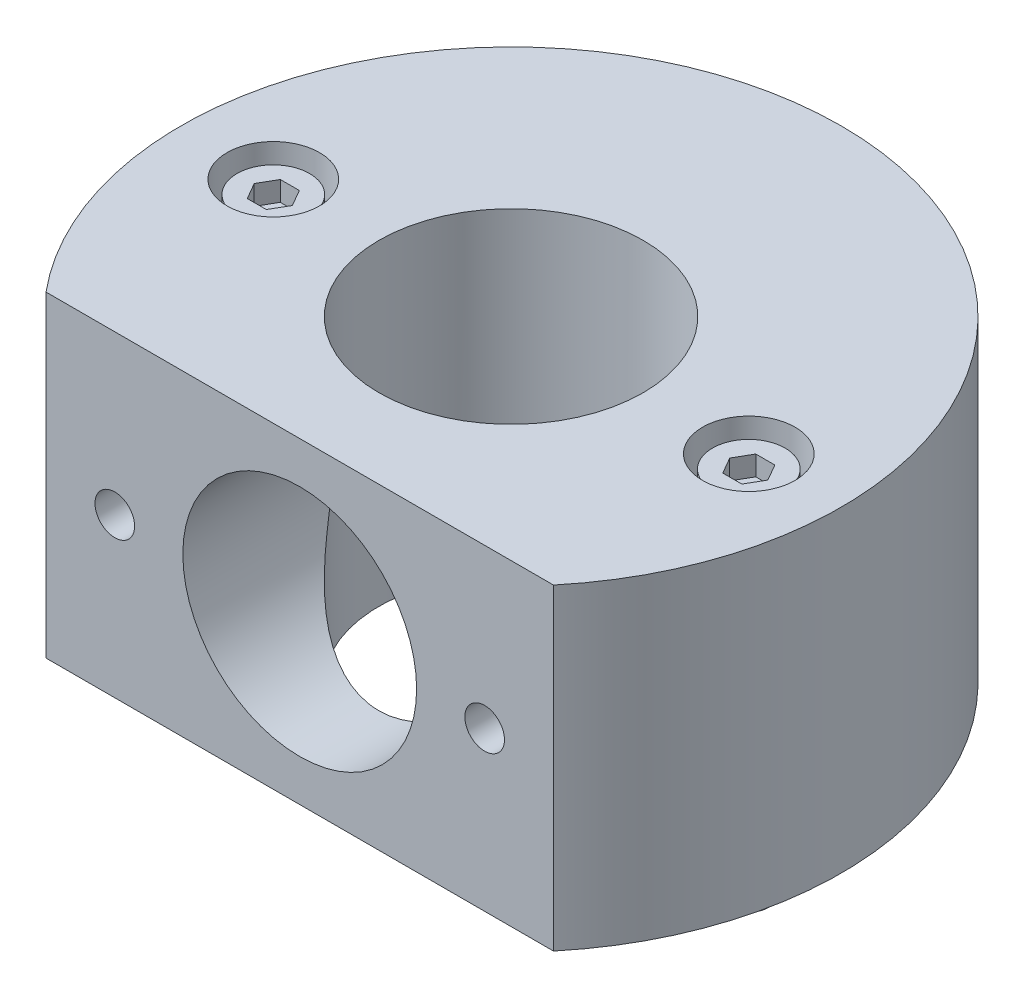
ISO-10303-21;
HEADER;
FILE_DESCRIPTION(('STEP AP214'),'2;1');
FILE_NAME('part.step','',(''),(''),'','','');
FILE_SCHEMA(('AUTOMOTIVE_DESIGN { 1 0 10303 214 1 1 1 1 }'));
ENDSEC;
DATA;
#1=APPLICATION_CONTEXT('core data for automotive mechanical design processes');
#2=APPLICATION_PROTOCOL_DEFINITION('international standard','automotive_design',2000,#1);
#3=PRODUCT_CONTEXT('',#1,'mechanical');
#4=PRODUCT('Part','Part','',(#3));
#5=PRODUCT_RELATED_PRODUCT_CATEGORY('part','',(#4));
#6=PRODUCT_DEFINITION_FORMATION('','',#4);
#7=PRODUCT_DEFINITION_CONTEXT('part definition',#1,'design');
#8=PRODUCT_DEFINITION('design','',#6,#7);
#9=PRODUCT_DEFINITION_SHAPE('','',#8);
#10=(LENGTH_UNIT() NAMED_UNIT(*) SI_UNIT(.MILLI.,.METRE.));
#11=(NAMED_UNIT(*) PLANE_ANGLE_UNIT() SI_UNIT($,.RADIAN.));
#12=(NAMED_UNIT(*) SI_UNIT($,.STERADIAN.) SOLID_ANGLE_UNIT());
#13=UNCERTAINTY_MEASURE_WITH_UNIT(LENGTH_MEASURE(1.E-05),#10,'distance_accuracy_value','');
#14=(GEOMETRIC_REPRESENTATION_CONTEXT(3) GLOBAL_UNCERTAINTY_ASSIGNED_CONTEXT((#13)) GLOBAL_UNIT_ASSIGNED_CONTEXT((#10,
#11,#12)) REPRESENTATION_CONTEXT('',''));
#15=CARTESIAN_POINT('',(0.,0.,0.));
#16=DIRECTION('',(0.,0.,1.));
#17=DIRECTION('',(1.,0.,0.));
#18=AXIS2_PLACEMENT_3D('',#15,#16,#17);
#19=CARTESIAN_POINT('',(-1.6759110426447E-13,24.,0.));
#20=DIRECTION('',(0.,-1.,0.));
#21=DIRECTION('',(1.,0.,0.));
#22=AXIS2_PLACEMENT_3D('',#19,#20,#21);
#23=CYLINDRICAL_SURFACE('',#22,10.);
#24=CARTESIAN_POINT('',(0.,0.,0.));
#25=DIRECTION('',(0.,-1.,0.));
#26=DIRECTION('',(1.,0.,0.));
#27=AXIS2_PLACEMENT_3D('',#24,#25,#26);
#28=CIRCLE('',#27,10.);
#29=CARTESIAN_POINT('',(10.,0.,0.));
#30=VERTEX_POINT('',#29);
#31=EDGE_CURVE('E272',#30,#30,#28,.T.);
#32=ORIENTED_EDGE('',*,*,#31,.T.);
#33=EDGE_LOOP('',(#32));
#34=FACE_BOUND('',#33,.T.);
#35=CARTESIAN_POINT('',(0.,3.15000000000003,10.));
#36=CARTESIAN_POINT('',(0.206380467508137,3.14999912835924,10.0000008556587));
#37=CARTESIAN_POINT('',(0.412750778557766,3.15723077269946,9.99359909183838));
#38=CARTESIAN_POINT('',(0.823691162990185,3.18600816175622,9.9681446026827));
#39=CARTESIAN_POINT('',(1.02826133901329,3.20755308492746,9.94909260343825));
#40=CARTESIAN_POINT('',(1.43396856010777,3.26454276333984,9.89876430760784));
#41=CARTESIAN_POINT('',(1.63510474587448,3.29999094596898,9.86748499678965));
#42=CARTESIAN_POINT('',(2.0324039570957,3.38413830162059,9.79337408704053));
#43=CARTESIAN_POINT('',(2.22856680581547,3.43283794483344,9.75054207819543));
#44=CARTESIAN_POINT('',(2.61342425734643,3.54232360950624,9.65448624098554));
#45=CARTESIAN_POINT('',(2.80215859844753,3.60303034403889,9.60133062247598));
#46=CARTESIAN_POINT('',(3.17258799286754,3.73586515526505,9.48537687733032));
#47=CARTESIAN_POINT('',(3.35427991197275,3.80799824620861,9.42257451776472));
#48=CARTESIAN_POINT('',(3.70980998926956,3.96274934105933,9.28834833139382));
#49=CARTESIAN_POINT('',(3.88364858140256,4.04536676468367,9.21692498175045));
#50=CARTESIAN_POINT('',(4.22301208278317,4.22021068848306,9.06645689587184));
#51=CARTESIAN_POINT('',(4.38853513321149,4.31243932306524,8.98741046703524));
#52=CARTESIAN_POINT('',(4.77399760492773,4.54347298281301,8.79046888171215));
#53=CARTESIAN_POINT('',(4.98990343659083,4.68638764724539,8.66947011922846));
#54=CARTESIAN_POINT('',(5.40458421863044,4.98725111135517,8.41720967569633));
#55=CARTESIAN_POINT('',(5.6033529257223,5.14520534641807,8.28594428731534));
#56=CARTESIAN_POINT('',(5.98409067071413,5.47491605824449,8.0153179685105));
#57=CARTESIAN_POINT('',(6.16602108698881,5.64670265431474,7.87593956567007));
#58=CARTESIAN_POINT('',(6.51269405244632,6.00258147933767,7.59177462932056));
#59=CARTESIAN_POINT('',(6.67743888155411,6.18667207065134,7.44698881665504));
#60=CARTESIAN_POINT('',(6.99346845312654,6.57071598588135,7.15117253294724));
#61=CARTESIAN_POINT('',(7.14437099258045,6.77093154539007,7.00007480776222));
#62=CARTESIAN_POINT('',(7.42867018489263,7.18334942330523,6.69760641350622));
#63=CARTESIAN_POINT('',(7.56206158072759,7.39555531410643,6.54623567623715));
#64=CARTESIAN_POINT('',(7.81102911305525,7.83186908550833,6.24704704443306));
#65=CARTESIAN_POINT('',(7.9266382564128,8.05595385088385,6.09922300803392));
#66=CARTESIAN_POINT('',(8.1398755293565,8.51726119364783,5.8115760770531));
#67=CARTESIAN_POINT('',(8.23751656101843,8.7544741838,5.67174749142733));
#68=CARTESIAN_POINT('',(8.41528968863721,9.24768772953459,5.40453567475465));
#69=CARTESIAN_POINT('',(8.49512079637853,9.50392589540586,5.27738396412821));
#70=CARTESIAN_POINT('',(8.63299449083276,10.0331527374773,5.04868337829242));
#71=CARTESIAN_POINT('',(8.69107208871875,10.3061136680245,4.94709344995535));
#72=CARTESIAN_POINT('',(8.77458847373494,10.8228317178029,4.79717917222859));
#73=CARTESIAN_POINT('',(8.80379230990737,11.0641487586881,4.74288934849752));
#74=CARTESIAN_POINT('',(8.83254889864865,11.4310606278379,4.68897062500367));
#75=CARTESIAN_POINT('',(8.83962645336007,11.5541235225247,4.67558354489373));
#76=CARTESIAN_POINT('',(8.84862687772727,11.8011330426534,4.65853098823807));
#77=CARTESIAN_POINT('',(8.85054987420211,11.925079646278,4.65486527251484));
#78=CARTESIAN_POINT('',(8.84917800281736,12.1730688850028,4.65747240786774));
#79=CARTESIAN_POINT('',(8.8458734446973,12.2971112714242,4.66376371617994));
#80=CARTESIAN_POINT('',(8.83412766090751,12.5440551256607,4.68597215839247));
#81=CARTESIAN_POINT('',(8.82568628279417,12.6669565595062,4.70188957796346));
#82=CARTESIAN_POINT('',(8.79290164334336,13.033123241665,4.76309635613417));
#83=CARTESIAN_POINT('',(8.76110012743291,13.2735679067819,4.82183460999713));
#84=CARTESIAN_POINT('',(8.68932062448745,13.6888066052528,4.94971718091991));
#85=CARTESIAN_POINT('',(8.6528806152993,13.8660296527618,5.01340172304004));
#86=CARTESIAN_POINT('',(8.57057502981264,14.2135016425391,5.15284515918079));
#87=CARTESIAN_POINT('',(8.5247034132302,14.3837460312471,5.22861178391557));
#88=CARTESIAN_POINT('',(8.42412730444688,14.7179338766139,5.38916281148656));
#89=CARTESIAN_POINT('',(8.36939242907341,14.8818531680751,5.47397787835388));
#90=CARTESIAN_POINT('',(8.25173000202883,15.2032342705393,5.64979347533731));
#91=CARTESIAN_POINT('',(8.18880323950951,15.3606967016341,5.74079340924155));
#92=CARTESIAN_POINT('',(8.00787687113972,15.7787542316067,5.99266286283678));
#93=CARTESIAN_POINT('',(7.88235011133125,16.0337137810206,6.157521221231));
#94=CARTESIAN_POINT('',(7.60909131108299,16.5281343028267,6.49219193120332));
#95=CARTESIAN_POINT('',(7.46134510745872,16.7675852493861,6.66200738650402));
#96=CARTESIAN_POINT('',(7.1438507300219,17.2313274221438,7.00138364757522));
#97=CARTESIAN_POINT('',(6.97411685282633,17.4556283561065,7.1709445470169));
#98=CARTESIAN_POINT('',(6.61240140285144,17.8888205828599,7.50578947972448));
#99=CARTESIAN_POINT('',(6.42042973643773,18.0977186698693,7.67107537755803));
#100=CARTESIAN_POINT('',(6.05516055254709,18.4582765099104,7.96102007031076));
#101=CARTESIAN_POINT('',(5.88597462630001,18.6129511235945,8.08711870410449));
#102=CARTESIAN_POINT('',(5.53314197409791,18.9108714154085,8.33249688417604));
#103=CARTESIAN_POINT('',(5.34949518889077,19.0541170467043,8.45177640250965));
#104=CARTESIAN_POINT('',(4.96810411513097,19.3277167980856,8.68144117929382));
#105=CARTESIAN_POINT('',(4.77038192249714,19.4580903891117,8.79183982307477));
#106=CARTESIAN_POINT('',(4.3609178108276,19.7046720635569,9.00196149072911));
#107=CARTESIAN_POINT('',(4.14917916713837,19.8208834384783,9.10168699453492));
#108=CARTESIAN_POINT('',(3.75685635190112,20.015374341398,9.26940261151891));
#109=CARTESIAN_POINT('',(3.57870341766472,20.0965599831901,9.3397206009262));
#110=CARTESIAN_POINT('',(3.21453755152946,20.2479154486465,9.47123038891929));
#111=CARTESIAN_POINT('',(3.02852633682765,20.3180876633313,9.53242416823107));
#112=CARTESIAN_POINT('',(2.64949037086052,20.4464620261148,9.6446487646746));
#113=CARTESIAN_POINT('',(2.45646787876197,20.5046679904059,9.6956828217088));
#114=CARTESIAN_POINT('',(2.06442887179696,20.6082362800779,9.78665514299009));
#115=CARTESIAN_POINT('',(1.86541228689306,20.6535984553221,9.82659327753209));
#116=CARTESIAN_POINT('',(1.46147735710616,20.730929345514,9.89476080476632));
#117=CARTESIAN_POINT('',(1.25652988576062,20.7628125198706,9.92291540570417));
#118=CARTESIAN_POINT('',(0.84355653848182,20.8121593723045,9.96651990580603));
#119=CARTESIAN_POINT('',(0.635530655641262,20.8296230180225,9.98196977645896));
#120=CARTESIAN_POINT('',(0.218262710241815,20.8497728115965,9.99979783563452));
#121=CARTESIAN_POINT('',(0.00902101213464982,20.8524631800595,10.0021797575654));
#122=CARTESIAN_POINT('',(-0.408854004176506,20.8430202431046,9.99382318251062));
#123=CARTESIAN_POINT('',(-0.617487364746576,20.8308879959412,9.98308562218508));
#124=CARTESIAN_POINT('',(-1.01166226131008,20.7939892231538,9.9504613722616));
#125=CARTESIAN_POINT('',(-1.19743662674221,20.7705993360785,9.92978980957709));
#126=CARTESIAN_POINT('',(-1.5658328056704,20.7123735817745,9.87839895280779));
#127=CARTESIAN_POINT('',(-1.74845355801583,20.6775339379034,9.84767634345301));
#128=CARTESIAN_POINT('',(-2.10932811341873,20.5969420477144,9.77673500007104));
#129=CARTESIAN_POINT('',(-2.28758297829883,20.5511924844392,9.73651860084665));
#130=CARTESIAN_POINT('',(-2.63891099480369,20.4493856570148,9.64722864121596));
#131=CARTESIAN_POINT('',(-2.8119821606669,20.3933244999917,9.59815173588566));
#132=CARTESIAN_POINT('',(-3.16070874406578,20.2685194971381,9.48920122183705));
#133=CARTESIAN_POINT('',(-3.33605539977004,20.199279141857,9.42890836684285));
#134=CARTESIAN_POINT('',(-3.67952493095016,20.0510018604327,9.30025692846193));
#135=CARTESIAN_POINT('',(-3.8476449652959,19.9719611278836,9.23189521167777));
#136=CARTESIAN_POINT('',(-4.34036098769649,19.7213604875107,9.01607688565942));
#137=CARTESIAN_POINT('',(-4.65352259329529,19.5362456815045,8.85781989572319));
#138=CARTESIAN_POINT('',(-5.17452922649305,19.184721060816,8.56102529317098));
#139=CARTESIAN_POINT('',(-5.3894650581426,19.0247108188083,8.42705205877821));
#140=CARTESIAN_POINT('',(-5.80046357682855,18.6893512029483,8.14960312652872));
#141=CARTESIAN_POINT('',(-5.99652454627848,18.5140004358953,8.00612656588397));
#142=CARTESIAN_POINT('',(-6.37052220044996,18.1487858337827,7.71189353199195));
#143=CARTESIAN_POINT('',(-6.54838519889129,17.9588680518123,7.56111084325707));
#144=CARTESIAN_POINT('',(-6.88533139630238,17.5661160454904,7.25561141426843));
#145=CARTESIAN_POINT('',(-7.04441857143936,17.3632845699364,7.10089551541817));
#146=CARTESIAN_POINT('',(-7.34749897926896,16.9402461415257,6.78696726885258));
#147=CARTESIAN_POINT('',(-7.49106215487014,16.7197473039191,6.62773320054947));
#148=CARTESIAN_POINT('',(-7.75890872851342,16.2651504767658,6.31206540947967));
#149=CARTESIAN_POINT('',(-7.88317995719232,16.0310440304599,6.15563350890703));
#150=CARTESIAN_POINT('',(-8.11148885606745,15.5492310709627,5.85147149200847));
#151=CARTESIAN_POINT('',(-8.2156068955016,15.3015838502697,5.70370852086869));
#152=CARTESIAN_POINT('',(-8.40299443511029,14.7903854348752,5.4238289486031));
#153=CARTESIAN_POINT('',(-8.48629578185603,14.5268593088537,5.29168861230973));
#154=CARTESIAN_POINT('',(-8.62138067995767,14.0139096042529,5.06821767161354));
#155=CARTESIAN_POINT('',(-8.67573245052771,13.7665281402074,4.97390416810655));
#156=CARTESIAN_POINT('',(-8.74178670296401,13.3857234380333,4.8562542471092));
#157=CARTESIAN_POINT('',(-8.76121502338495,13.2572899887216,4.82102931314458));
#158=CARTESIAN_POINT('',(-8.79457299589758,12.9975508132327,4.75990524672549));
#159=CARTESIAN_POINT('',(-8.80850559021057,12.8662466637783,4.73400112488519));
#160=CARTESIAN_POINT('',(-8.83068441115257,12.5996930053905,4.69250280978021));
#161=CARTESIAN_POINT('',(-8.83885153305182,12.4644141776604,4.67705215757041));
#162=CARTESIAN_POINT('',(-8.84894310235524,12.1927927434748,4.65793155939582));
#163=CARTESIAN_POINT('',(-8.85086818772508,12.0564502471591,4.65426040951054));
#164=CARTESIAN_POINT('',(-8.84841242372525,11.7839695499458,4.65892732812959));
#165=CARTESIAN_POINT('',(-8.84402873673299,11.6478314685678,4.66727080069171));
#166=CARTESIAN_POINT('',(-8.82909315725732,11.3770980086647,4.69546184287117));
#167=CARTESIAN_POINT('',(-8.81854023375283,11.2425028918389,4.71531133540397));
#168=CARTESIAN_POINT('',(-8.78967618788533,10.9572007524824,4.76892450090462));
#169=CARTESIAN_POINT('',(-8.77048523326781,10.8068784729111,4.80424801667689));
#170=CARTESIAN_POINT('',(-8.72503114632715,10.5104164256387,4.88630958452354));
#171=CARTESIAN_POINT('',(-8.69876228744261,10.3642801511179,4.93305687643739));
#172=CARTESIAN_POINT('',(-8.63963219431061,10.0762146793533,5.03589877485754));
#173=CARTESIAN_POINT('',(-8.60675047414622,9.93430016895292,5.09202233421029));
#174=CARTESIAN_POINT('',(-8.53493993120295,9.65520665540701,5.21149405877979));
#175=CARTESIAN_POINT('',(-8.49601236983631,9.51802667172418,5.27484071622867));
#176=CARTESIAN_POINT('',(-8.37956267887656,9.14180338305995,5.45915556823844));
#177=CARTESIAN_POINT('',(-8.2957969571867,8.90765825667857,5.58620020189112));
#178=CARTESIAN_POINT('',(-8.11145729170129,8.45216041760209,5.85067035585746));
#179=CARTESIAN_POINT('',(-8.01087031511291,8.23081780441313,5.98810387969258));
#180=CARTESIAN_POINT('',(-7.79337548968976,7.79950123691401,6.268560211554));
#181=CARTESIAN_POINT('',(-7.67644398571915,7.58954438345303,6.41159090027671));
#182=CARTESIAN_POINT('',(-7.42661512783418,7.18074243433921,6.69938181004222));
#183=CARTESIAN_POINT('',(-7.29372221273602,6.98189427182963,6.84414154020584));
#184=CARTESIAN_POINT('',(-7.00014634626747,6.57896215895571,7.14462554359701));
#185=CARTESIAN_POINT('',(-6.83807061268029,6.3758218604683,7.30025868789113));
#186=CARTESIAN_POINT('',(-6.4948392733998,5.98272144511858,7.60723989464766));
#187=CARTESIAN_POINT('',(-6.31367994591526,5.79276391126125,7.75858711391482));
#188=CARTESIAN_POINT('',(-5.93250876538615,5.42753098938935,8.05377710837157));
#189=CARTESIAN_POINT('',(-5.73254059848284,5.252223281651,8.19763612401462));
#190=CARTESIAN_POINT('',(-5.31325521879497,4.91736115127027,8.47540783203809));
#191=CARTESIAN_POINT('',(-5.09393622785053,4.75780817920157,8.60931960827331));
#192=CARTESIAN_POINT('',(-4.69636491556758,4.49616959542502,8.83071244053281));
#193=CARTESIAN_POINT('',(-4.5224417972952,4.38999184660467,8.92115524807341));
#194=CARTESIAN_POINT('',(-4.16454947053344,4.18839401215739,9.09373255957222));
#195=CARTESIAN_POINT('',(-3.98058277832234,4.09297125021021,9.17586912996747));
#196=CARTESIAN_POINT('',(-3.6031269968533,3.9139881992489,9.33054451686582));
#197=CARTESIAN_POINT('',(-3.40964033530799,3.83042490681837,9.40308576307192));
#198=CARTESIAN_POINT('',(-3.01388237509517,3.67629294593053,9.53730377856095));
#199=CARTESIAN_POINT('',(-2.81161096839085,3.60572443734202,9.5989804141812));
#200=CARTESIAN_POINT('',(-2.39920986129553,3.47868079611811,9.71027504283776));
#201=CARTESIAN_POINT('',(-2.18907285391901,3.4222191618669,9.75988148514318));
#202=CARTESIAN_POINT('',(-1.76260899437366,3.32454315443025,9.84583733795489));
#203=CARTESIAN_POINT('',(-1.54628223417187,3.2833285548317,9.88218694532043));
#204=CARTESIAN_POINT('',(-1.10941365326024,3.2170348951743,9.94071090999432));
#205=CARTESIAN_POINT('',(-0.888874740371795,3.19194509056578,9.96289470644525));
#206=CARTESIAN_POINT('',(-0.445553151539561,3.1584287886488,9.99253819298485));
#207=CARTESIAN_POINT('',(-0.222770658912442,3.15000094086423,9.99999907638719));
#208=CARTESIAN_POINT('',(0.,3.15000000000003,10.));
#209=B_SPLINE_CURVE_WITH_KNOTS('',3,(#35,#36,#37,#38,#39,#40,#41,#42,#43,#44,#45,#46,#47,#48,
#49,#50,#51,#52,#53,#54,#55,#56,#57,#58,#59,#60,#61,#62,#63,#64,#65,#66,#67,#68,#69,#70,#71,#72,
#73,#74,#75,#76,#77,#78,#79,#80,#81,#82,#83,#84,#85,#86,#87,#88,#89,#90,#91,#92,#93,#94,#95,#96,
#97,#98,#99,#100,#101,#102,#103,#104,#105,#106,#107,#108,#109,#110,#111,#112,#113,#114,#115,
#116,#117,#118,#119,#120,#121,#122,#123,#124,#125,#126,#127,#128,#129,#130,#131,#132,#133,#134,
#135,#136,#137,#138,#139,#140,#141,#142,#143,#144,#145,#146,#147,#148,#149,#150,#151,#152,#153,
#154,#155,#156,#157,#158,#159,#160,#161,#162,#163,#164,#165,#166,#167,#168,#169,#170,#171,#172,
#173,#174,#175,#176,#177,#178,#179,#180,#181,#182,#183,#184,#185,#186,#187,#188,#189,#190,#191,
#192,#193,#194,#195,#196,#197,#198,#199,#200,#201,#202,#203,#204,#205,#206,#207,#208),
.UNSPECIFIED.,.T.,.F.,(4,2,2,2,2,2,2,2,2,2,2,2,2,2,2,2,2,2,2,2,2,2,2,2,2,2,2,2,2,2,2,2,2,2,2,2,
2,2,2,2,2,2,2,2,2,2,2,2,2,2,2,2,2,2,2,2,2,2,2,2,2,2,2,2,2,2,2,2,2,2,2,2,2,2,2,2,2,2,2,2,2,2,2,2,
2,2,4),(0.,0.618900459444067,1.23776539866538,1.85678299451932,2.47582255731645,
3.09090322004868,3.70625455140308,4.32157183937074,4.93702606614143,5.79316440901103,
6.64961334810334,7.5079803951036,8.36623342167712,9.24363032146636,10.121290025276,
10.9973004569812,11.872679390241,12.7618881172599,13.6496594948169,14.3934994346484,
14.7650420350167,15.1365754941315,15.5087984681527,15.8810324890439,16.6263383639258,
17.2010392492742,17.7761093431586,18.3531942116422,18.9302235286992,19.914452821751,
20.8993121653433,21.8835343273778,22.8673197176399,23.6515381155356,24.4357597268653,
25.2187762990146,26.0016105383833,26.6251010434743,27.2484560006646,27.871611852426,
28.4947749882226,29.1218355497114,29.7488975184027,30.3757803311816,31.0026183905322,
31.5671104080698,32.1317888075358,32.6963284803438,33.2610817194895,33.8542749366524,
34.4476992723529,35.6338549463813,36.5315411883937,37.4293090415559,38.3305790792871,
39.2316579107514,40.1534108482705,41.0757428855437,41.994317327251,42.9114777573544,
43.7197128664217,44.1230833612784,44.526237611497,44.934821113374,45.3433628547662,
45.7520884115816,46.1608822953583,46.6269517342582,47.0933993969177,47.5613149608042,
48.0291330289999,48.8655319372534,49.7025818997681,50.5408561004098,51.3788977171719,
52.2867484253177,53.1947765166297,54.1007453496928,55.0067975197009,55.6750506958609,
56.343137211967,57.0110542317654,57.6789794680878,58.3475413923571,59.0160933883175,
59.6841994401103,60.3522513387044),.UNSPECIFIED.);
#210=CARTESIAN_POINT('',(0.,3.15000000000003,10.));
#211=VERTEX_POINT('',#210);
#212=EDGE_CURVE('E19',#211,#211,#209,.T.);
#213=ORIENTED_EDGE('',*,*,#212,.T.);
#214=EDGE_LOOP('',(#213));
#215=FACE_BOUND('',#214,.T.);
#216=CARTESIAN_POINT('',(-1.6759110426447E-13,24.,0.));
#217=DIRECTION('',(0.,1.,0.));
#218=DIRECTION('',(-1.,0.,0.));
#219=AXIS2_PLACEMENT_3D('',#216,#217,#218);
#220=CIRCLE('',#219,10.);
#221=CARTESIAN_POINT('',(-10.0000000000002,23.9999999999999,0.));
#222=VERTEX_POINT('',#221);
#223=EDGE_CURVE('E288',#222,#222,#220,.T.);
#224=ORIENTED_EDGE('',*,*,#223,.T.);
#225=EDGE_LOOP('',(#224));
#226=FACE_BOUND('',#225,.T.);
#227=ADVANCED_FACE('F15',(#34,#215,#226),#23,.F.);
#228=CARTESIAN_POINT('',(-1.6759110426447E-13,24.,0.));
#229=DIRECTION('',(0.,1.,0.));
#230=DIRECTION('',(-1.,0.,0.));
#231=AXIS2_PLACEMENT_3D('',#228,#229,#230);
#232=PLANE('',#231);
#233=CARTESIAN_POINT('',(18.,24.,0.));
#234=DIRECTION('',(0.,1.,0.));
#235=DIRECTION('',(-1.,0.,0.));
#236=AXIS2_PLACEMENT_3D('',#233,#234,#235);
#237=CIRCLE('',#236,3.5);
#238=CARTESIAN_POINT('',(14.5,24.,0.));
#239=VERTEX_POINT('',#238);
#240=EDGE_CURVE('E291',#239,#239,#237,.T.);
#241=ORIENTED_EDGE('',*,*,#240,.F.);
#242=EDGE_LOOP('',(#241));
#243=FACE_BOUND('',#242,.T.);
#244=ORIENTED_EDGE('',*,*,#223,.F.);
#245=EDGE_LOOP('',(#244));
#246=FACE_BOUND('',#245,.T.);
#247=CARTESIAN_POINT('',(-18.,24.,0.));
#248=DIRECTION('',(0.,1.,0.));
#249=DIRECTION('',(-1.,0.,0.));
#250=AXIS2_PLACEMENT_3D('',#247,#248,#249);
#251=CIRCLE('',#250,3.5);
#252=CARTESIAN_POINT('',(-21.5,24.,0.));
#253=VERTEX_POINT('',#252);
#254=EDGE_CURVE('E285',#253,#253,#251,.T.);
#255=ORIENTED_EDGE('',*,*,#254,.F.);
#256=EDGE_LOOP('',(#255));
#257=FACE_BOUND('',#256,.T.);
#258=DIRECTION('',(-1.,0.,0.));
#259=VECTOR('',#258,1.);
#260=CARTESIAN_POINT('',(-1.67591104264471E-13,24.,16.));
#261=LINE('',#260,#259);
#262=CARTESIAN_POINT('',(19.2093727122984,24.,16.));
#263=VERTEX_POINT('',#262);
#264=CARTESIAN_POINT('',(-19.2093727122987,24.,16.));
#265=VERTEX_POINT('',#264);
#266=EDGE_CURVE('E280',#263,#265,#261,.T.);
#267=ORIENTED_EDGE('',*,*,#266,.F.);
#268=CARTESIAN_POINT('',(-1.6759110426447E-13,24.,0.));
#269=DIRECTION('',(0.,1.,0.));
#270=DIRECTION('',(-1.,0.,0.));
#271=AXIS2_PLACEMENT_3D('',#268,#269,#270);
#272=CIRCLE('',#271,25.);
#273=EDGE_CURVE('E282',#263,#265,#272,.T.);
#274=ORIENTED_EDGE('',*,*,#273,.T.);
#275=EDGE_LOOP('',(#267,#274));
#276=FACE_BOUND('',#275,.T.);
#277=ADVANCED_FACE('F322',(#243,#246,#257,#276),#232,.T.);
#278=CARTESIAN_POINT('',(0.,0.,0.));
#279=DIRECTION('',(0.,1.,0.));
#280=DIRECTION('',(-1.,0.,0.));
#281=AXIS2_PLACEMENT_3D('',#278,#279,#280);
#282=PLANE('',#281);
#283=DIRECTION('',(1.,0.,0.));
#284=VECTOR('',#283,1.);
#285=CARTESIAN_POINT('',(0.,0.,16.));
#286=LINE('',#285,#284);
#287=CARTESIAN_POINT('',(-19.2093727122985,0.,16.));
#288=VERTEX_POINT('',#287);
#289=CARTESIAN_POINT('',(19.2093727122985,1.90002034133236E-13,16.));
#290=VERTEX_POINT('',#289);
#291=EDGE_CURVE('E275',#288,#290,#286,.T.);
#292=ORIENTED_EDGE('',*,*,#291,.F.);
#293=CARTESIAN_POINT('',(0.,0.,0.));
#294=DIRECTION('',(0.,-1.,0.));
#295=DIRECTION('',(1.,0.,0.));
#296=AXIS2_PLACEMENT_3D('',#293,#294,#295);
#297=CIRCLE('',#296,25.);
#298=EDGE_CURVE('E277',#288,#290,#297,.T.);
#299=ORIENTED_EDGE('',*,*,#298,.T.);
#300=EDGE_LOOP('',(#292,#299));
#301=FACE_BOUND('',#300,.T.);
#302=ORIENTED_EDGE('',*,*,#31,.F.);
#303=EDGE_LOOP('',(#302));
#304=FACE_BOUND('',#303,.T.);
#305=CARTESIAN_POINT('',(-18.,-1.25693328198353E-13,0.));
#306=DIRECTION('',(0.,-1.,0.));
#307=DIRECTION('',(1.,0.,0.));
#308=AXIS2_PLACEMENT_3D('',#305,#306,#307);
#309=CIRCLE('',#308,1.75);
#310=CARTESIAN_POINT('',(-16.25,-1.13473143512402E-13,0.));
#311=VERTEX_POINT('',#310);
#312=EDGE_CURVE('E269',#311,#311,#309,.T.);
#313=ORIENTED_EDGE('',*,*,#312,.F.);
#314=EDGE_LOOP('',(#313));
#315=FACE_BOUND('',#314,.T.);
#316=CARTESIAN_POINT('',(18.,1.25693328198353E-13,0.));
#317=DIRECTION('',(0.,-1.,0.));
#318=DIRECTION('',(1.,0.,0.));
#319=AXIS2_PLACEMENT_3D('',#316,#317,#318);
#320=CIRCLE('',#319,1.75);
#321=CARTESIAN_POINT('',(19.75,1.37913512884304E-13,0.));
#322=VERTEX_POINT('',#321);
#323=EDGE_CURVE('E266',#322,#322,#320,.T.);
#324=ORIENTED_EDGE('',*,*,#323,.F.);
#325=EDGE_LOOP('',(#324));
#326=FACE_BOUND('',#325,.T.);
#327=ADVANCED_FACE('F328',(#301,#304,#315,#326),#282,.F.);
#328=CARTESIAN_POINT('',(-1.6759110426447E-13,24.,0.));
#329=DIRECTION('',(0.,-1.,0.));
#330=DIRECTION('',(1.,0.,0.));
#331=AXIS2_PLACEMENT_3D('',#328,#329,#330);
#332=CYLINDRICAL_SURFACE('',#331,25.);
#333=ORIENTED_EDGE('',*,*,#298,.F.);
#334=DIRECTION('',(0.,-1.,0.));
#335=VECTOR('',#334,1.);
#336=CARTESIAN_POINT('',(-19.2093727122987,24.,16.));
#337=LINE('',#336,#335);
#338=EDGE_CURVE('E10',#265,#288,#337,.T.);
#339=ORIENTED_EDGE('',*,*,#338,.F.);
#340=ORIENTED_EDGE('',*,*,#273,.F.);
#341=DIRECTION('',(0.,-1.,0.));
#342=VECTOR('',#341,1.);
#343=CARTESIAN_POINT('',(19.2093727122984,24.,16.));
#344=LINE('',#343,#342);
#345=EDGE_CURVE('E29',#263,#290,#344,.T.);
#346=ORIENTED_EDGE('',*,*,#345,.T.);
#347=EDGE_LOOP('',(#333,#339,#340,#346));
#348=FACE_BOUND('',#347,.T.);
#349=ADVANCED_FACE('F17',(#348),#332,.T.);
#350=CARTESIAN_POINT('',(19.2093727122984,24.,16.));
#351=DIRECTION('',(0.,0.,-1.));
#352=DIRECTION('',(0.,-1.,0.));
#353=AXIS2_PLACEMENT_3D('',#350,#351,#352);
#354=PLANE('',#353);
#355=CARTESIAN_POINT('',(-14.,12.,16.));
#356=DIRECTION('',(0.,0.,1.));
#357=DIRECTION('',(0.,1.,0.));
#358=AXIS2_PLACEMENT_3D('',#355,#356,#357);
#359=CIRCLE('',#358,1.5);
#360=CARTESIAN_POINT('',(-14.,13.5,16.));
#361=VERTEX_POINT('',#360);
#362=EDGE_CURVE('E251',#361,#361,#359,.T.);
#363=ORIENTED_EDGE('',*,*,#362,.F.);
#364=EDGE_LOOP('',(#363));
#365=FACE_BOUND('',#364,.T.);
#366=CARTESIAN_POINT('',(14.,12.0000000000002,16.));
#367=DIRECTION('',(0.,0.,1.));
#368=DIRECTION('',(0.,1.,0.));
#369=AXIS2_PLACEMENT_3D('',#366,#367,#368);
#370=CIRCLE('',#369,1.5);
#371=CARTESIAN_POINT('',(14.,13.5000000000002,16.));
#372=VERTEX_POINT('',#371);
#373=EDGE_CURVE('E255',#372,#372,#370,.T.);
#374=ORIENTED_EDGE('',*,*,#373,.F.);
#375=EDGE_LOOP('',(#374));
#376=FACE_BOUND('',#375,.T.);
#377=ORIENTED_EDGE('',*,*,#291,.T.);
#378=ORIENTED_EDGE('',*,*,#345,.F.);
#379=ORIENTED_EDGE('',*,*,#266,.T.);
#380=ORIENTED_EDGE('',*,*,#338,.T.);
#381=EDGE_LOOP('',(#377,#378,#379,#380));
#382=FACE_BOUND('',#381,.T.);
#383=CARTESIAN_POINT('',(0.,12.,16.));
#384=DIRECTION('',(0.,0.,1.));
#385=DIRECTION('',(0.,1.,0.));
#386=AXIS2_PLACEMENT_3D('',#383,#384,#385);
#387=CIRCLE('',#386,8.85);
#388=CARTESIAN_POINT('',(-1.45594771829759E-13,20.85,16.));
#389=VERTEX_POINT('',#388);
#390=EDGE_CURVE('E261',#389,#389,#387,.T.);
#391=ORIENTED_EDGE('',*,*,#390,.F.);
#392=EDGE_LOOP('',(#391));
#393=FACE_BOUND('',#392,.T.);
#394=ADVANCED_FACE('F308',(#365,#376,#382,#393),#354,.F.);
#395=CARTESIAN_POINT('',(0.,12.,16.));
#396=DIRECTION('',(0.,0.,-1.));
#397=DIRECTION('',(0.,-1.,0.));
#398=AXIS2_PLACEMENT_3D('',#395,#396,#397);
#399=CYLINDRICAL_SURFACE('',#398,8.85);
#400=ORIENTED_EDGE('',*,*,#390,.T.);
#401=EDGE_LOOP('',(#400));
#402=FACE_BOUND('',#401,.T.);
#403=ORIENTED_EDGE('',*,*,#212,.F.);
#404=EDGE_LOOP('',(#403));
#405=FACE_BOUND('',#404,.T.);
#406=ADVANCED_FACE('F305',(#402,#405),#399,.F.);
#407=CARTESIAN_POINT('',(18.,24.,0.));
#408=DIRECTION('',(0.,1.,0.));
#409=DIRECTION('',(-1.,0.,0.));
#410=AXIS2_PLACEMENT_3D('',#407,#408,#409);
#411=CYLINDRICAL_SURFACE('',#410,1.75);
#412=CARTESIAN_POINT('',(18.,20.,0.));
#413=DIRECTION('',(0.,-1.,0.));
#414=DIRECTION('',(1.,0.,0.));
#415=AXIS2_PLACEMENT_3D('',#412,#413,#414);
#416=CIRCLE('',#415,1.75);
#417=CARTESIAN_POINT('',(19.75,20.,0.));
#418=VERTEX_POINT('',#417);
#419=EDGE_CURVE('E248',#418,#418,#416,.F.);
#420=ORIENTED_EDGE('',*,*,#419,.T.);
#421=EDGE_LOOP('',(#420));
#422=FACE_BOUND('',#421,.T.);
#423=ORIENTED_EDGE('',*,*,#323,.T.);
#424=EDGE_LOOP('',(#423));
#425=FACE_BOUND('',#424,.T.);
#426=ADVANCED_FACE('F307',(#422,#425),#411,.F.);
#427=CARTESIAN_POINT('',(14.4999999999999,20.,0.));
#428=DIRECTION('',(0.,-1.,0.));
#429=DIRECTION('',(1.,0.,0.));
#430=AXIS2_PLACEMENT_3D('',#427,#428,#429);
#431=PLANE('',#430);
#432=CARTESIAN_POINT('',(18.,20.,0.));
#433=DIRECTION('',(0.,1.,0.));
#434=DIRECTION('',(-0.866025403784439,0.,-0.5));
#435=AXIS2_PLACEMENT_3D('',#432,#433,#434);
#436=CIRCLE('',#435,2.75);
#437=CARTESIAN_POINT('',(15.6184301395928,20.,-1.37500000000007));
#438=VERTEX_POINT('',#437);
#439=EDGE_CURVE('E239',#438,#438,#436,.T.);
#440=ORIENTED_EDGE('',*,*,#439,.F.);
#441=EDGE_LOOP('',(#440));
#442=FACE_BOUND('',#441,.T.);
#443=CARTESIAN_POINT('',(18.,20.,0.));
#444=DIRECTION('',(0.,1.,0.));
#445=DIRECTION('',(-1.,0.,0.));
#446=AXIS2_PLACEMENT_3D('',#443,#444,#445);
#447=CIRCLE('',#446,3.5);
#448=CARTESIAN_POINT('',(14.5,20.,0.));
#449=VERTEX_POINT('',#448);
#450=EDGE_CURVE('E297',#449,#449,#447,.T.);
#451=ORIENTED_EDGE('',*,*,#450,.T.);
#452=EDGE_LOOP('',(#451));
#453=FACE_BOUND('',#452,.T.);
#454=ADVANCED_FACE('F316',(#442,#453),#431,.F.);
#455=CARTESIAN_POINT('',(18.,24.,0.));
#456=DIRECTION('',(0.,1.,0.));
#457=DIRECTION('',(-1.,0.,0.));
#458=AXIS2_PLACEMENT_3D('',#455,#456,#457);
#459=CYLINDRICAL_SURFACE('',#458,3.5);
#460=ORIENTED_EDGE('',*,*,#240,.T.);
#461=EDGE_LOOP('',(#460));
#462=FACE_BOUND('',#461,.T.);
#463=ORIENTED_EDGE('',*,*,#450,.F.);
#464=EDGE_LOOP('',(#463));
#465=FACE_BOUND('',#464,.T.);
#466=ADVANCED_FACE('F351',(#462,#465),#459,.F.);
#467=CARTESIAN_POINT('',(-18.,24.,0.));
#468=DIRECTION('',(0.,1.,0.));
#469=DIRECTION('',(-1.,0.,0.));
#470=AXIS2_PLACEMENT_3D('',#467,#468,#469);
#471=CYLINDRICAL_SURFACE('',#470,1.75);
#472=CARTESIAN_POINT('',(-18.,20.,0.));
#473=DIRECTION('',(0.,-1.,0.));
#474=DIRECTION('',(1.,0.,0.));
#475=AXIS2_PLACEMENT_3D('',#472,#473,#474);
#476=CIRCLE('',#475,1.75);
#477=CARTESIAN_POINT('',(-16.25,20.,0.));
#478=VERTEX_POINT('',#477);
#479=EDGE_CURVE('E184',#478,#478,#476,.F.);
#480=ORIENTED_EDGE('',*,*,#479,.T.);
#481=EDGE_LOOP('',(#480));
#482=FACE_BOUND('',#481,.T.);
#483=ORIENTED_EDGE('',*,*,#312,.T.);
#484=EDGE_LOOP('',(#483));
#485=FACE_BOUND('',#484,.T.);
#486=ADVANCED_FACE('F348',(#482,#485),#471,.F.);
#487=CARTESIAN_POINT('',(-21.5,20.,0.));
#488=DIRECTION('',(0.,-1.,0.));
#489=DIRECTION('',(1.,0.,0.));
#490=AXIS2_PLACEMENT_3D('',#487,#488,#489);
#491=PLANE('',#490);
#492=CARTESIAN_POINT('',(-18.,20.,0.));
#493=DIRECTION('',(0.,1.,0.));
#494=DIRECTION('',(-0.866025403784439,0.,-0.5));
#495=AXIS2_PLACEMENT_3D('',#492,#493,#494);
#496=CIRCLE('',#495,2.75);
#497=CARTESIAN_POINT('',(-20.3815698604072,20.,-1.37500000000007));
#498=VERTEX_POINT('',#497);
#499=EDGE_CURVE('E175',#498,#498,#496,.T.);
#500=ORIENTED_EDGE('',*,*,#499,.F.);
#501=EDGE_LOOP('',(#500));
#502=FACE_BOUND('',#501,.T.);
#503=CARTESIAN_POINT('',(-18.,20.,0.));
#504=DIRECTION('',(0.,1.,0.));
#505=DIRECTION('',(-1.,0.,0.));
#506=AXIS2_PLACEMENT_3D('',#503,#504,#505);
#507=CIRCLE('',#506,3.5);
#508=CARTESIAN_POINT('',(-21.5,20.,0.));
#509=VERTEX_POINT('',#508);
#510=EDGE_CURVE('E294',#509,#509,#507,.T.);
#511=ORIENTED_EDGE('',*,*,#510,.T.);
#512=EDGE_LOOP('',(#511));
#513=FACE_BOUND('',#512,.T.);
#514=ADVANCED_FACE('F350',(#502,#513),#491,.F.);
#515=CARTESIAN_POINT('',(-18.,24.,0.));
#516=DIRECTION('',(0.,1.,0.));
#517=DIRECTION('',(-1.,0.,0.));
#518=AXIS2_PLACEMENT_3D('',#515,#516,#517);
#519=CYLINDRICAL_SURFACE('',#518,3.5);
#520=ORIENTED_EDGE('',*,*,#254,.T.);
#521=EDGE_LOOP('',(#520));
#522=FACE_BOUND('',#521,.T.);
#523=ORIENTED_EDGE('',*,*,#510,.F.);
#524=EDGE_LOOP('',(#523));
#525=FACE_BOUND('',#524,.T.);
#526=ADVANCED_FACE('F359',(#522,#525),#519,.F.);
#527=CARTESIAN_POINT('',(14.,12.0000000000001,10.));
#528=DIRECTION('',(0.,0.,1.));
#529=DIRECTION('',(0.,1.,0.));
#530=AXIS2_PLACEMENT_3D('',#527,#528,#529);
#531=PLANE('',#530);
#532=CARTESIAN_POINT('',(14.,12.0000000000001,10.));
#533=DIRECTION('',(0.,0.,1.));
#534=DIRECTION('',(0.,1.,0.));
#535=AXIS2_PLACEMENT_3D('',#532,#533,#534);
#536=CIRCLE('',#535,1.5);
#537=CARTESIAN_POINT('',(14.,13.5000000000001,9.99999999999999));
#538=VERTEX_POINT('',#537);
#539=EDGE_CURVE('E258',#538,#538,#536,.T.);
#540=ORIENTED_EDGE('',*,*,#539,.T.);
#541=EDGE_LOOP('',(#540));
#542=FACE_BOUND('',#541,.T.);
#543=ADVANCED_FACE('F448',(#542),#531,.T.);
#544=CARTESIAN_POINT('',(14.,12.0000000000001,10.));
#545=DIRECTION('',(0.,0.,1.));
#546=DIRECTION('',(0.,1.,0.));
#547=AXIS2_PLACEMENT_3D('',#544,#545,#546);
#548=CYLINDRICAL_SURFACE('',#547,1.5);
#549=ORIENTED_EDGE('',*,*,#539,.F.);
#550=EDGE_LOOP('',(#549));
#551=FACE_BOUND('',#550,.T.);
#552=ORIENTED_EDGE('',*,*,#373,.T.);
#553=EDGE_LOOP('',(#552));
#554=FACE_BOUND('',#553,.T.);
#555=ADVANCED_FACE('F443',(#551,#554),#548,.F.);
#556=CARTESIAN_POINT('',(-14.,12.,10.));
#557=DIRECTION('',(0.,0.,1.));
#558=DIRECTION('',(0.,1.,0.));
#559=AXIS2_PLACEMENT_3D('',#556,#557,#558);
#560=PLANE('',#559);
#561=CARTESIAN_POINT('',(-14.,12.,10.));
#562=DIRECTION('',(0.,0.,1.));
#563=DIRECTION('',(0.,1.,0.));
#564=AXIS2_PLACEMENT_3D('',#561,#562,#563);
#565=CIRCLE('',#564,1.5);
#566=CARTESIAN_POINT('',(-14.,13.5,9.99999999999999));
#567=VERTEX_POINT('',#566);
#568=EDGE_CURVE('E252',#567,#567,#565,.T.);
#569=ORIENTED_EDGE('',*,*,#568,.T.);
#570=EDGE_LOOP('',(#569));
#571=FACE_BOUND('',#570,.T.);
#572=ADVANCED_FACE('F440',(#571),#560,.T.);
#573=CARTESIAN_POINT('',(-14.,12.,10.));
#574=DIRECTION('',(0.,0.,1.));
#575=DIRECTION('',(0.,1.,0.));
#576=AXIS2_PLACEMENT_3D('',#573,#574,#575);
#577=CYLINDRICAL_SURFACE('',#576,1.5);
#578=ORIENTED_EDGE('',*,*,#568,.F.);
#579=EDGE_LOOP('',(#578));
#580=FACE_BOUND('',#579,.T.);
#581=ORIENTED_EDGE('',*,*,#362,.T.);
#582=EDGE_LOOP('',(#581));
#583=FACE_BOUND('',#582,.T.);
#584=ADVANCED_FACE('F380',(#580,#583),#577,.F.);
#585=CARTESIAN_POINT('',(18.,14.9999999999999,0.));
#586=DIRECTION('',(0.,1.,0.));
#587=DIRECTION('',(-0.866025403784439,0.,-0.5));
#588=AXIS2_PLACEMENT_3D('',#585,#586,#587);
#589=CYLINDRICAL_SURFACE('',#588,2.75);
#590=ORIENTED_EDGE('',*,*,#439,.T.);
#591=EDGE_LOOP('',(#590));
#592=FACE_BOUND('',#591,.T.);
#593=CARTESIAN_POINT('',(18.,23.,0.));
#594=DIRECTION('',(0.,1.,0.));
#595=DIRECTION('',(-0.866025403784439,0.,-0.5));
#596=AXIS2_PLACEMENT_3D('',#593,#594,#595);
#597=CIRCLE('',#596,2.75);
#598=CARTESIAN_POINT('',(15.6184301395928,23.,-1.37500000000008));
#599=VERTEX_POINT('',#598);
#600=EDGE_CURVE('E242',#599,#599,#597,.T.);
#601=ORIENTED_EDGE('',*,*,#600,.F.);
#602=EDGE_LOOP('',(#601));
#603=FACE_BOUND('',#602,.T.);
#604=ADVANCED_FACE('F376',(#592,#603),#589,.T.);
#605=CARTESIAN_POINT('',(18.,23.,0.));
#606=DIRECTION('',(0.,1.,0.));
#607=DIRECTION('',(-0.866025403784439,0.,-0.5));
#608=AXIS2_PLACEMENT_3D('',#605,#606,#607);
#609=PLANE('',#608);
#610=ORIENTED_EDGE('',*,*,#600,.T.);
#611=EDGE_LOOP('',(#610));
#612=FACE_BOUND('',#611,.T.);
#613=DIRECTION('',(1.,0.,0.));
#614=VECTOR('',#613,1.);
#615=CARTESIAN_POINT('',(17.2783121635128,23.,1.24999999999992));
#616=LINE('',#615,#614);
#617=CARTESIAN_POINT('',(17.2783121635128,23.,1.24999999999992));
#618=VERTEX_POINT('',#617);
#619=CARTESIAN_POINT('',(18.7216878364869,23.,1.24999999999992));
#620=VERTEX_POINT('',#619);
#621=EDGE_CURVE('E188',#618,#620,#616,.T.);
#622=ORIENTED_EDGE('',*,*,#621,.F.);
#623=DIRECTION('',(-0.5,0.,-0.866025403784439));
#624=VECTOR('',#623,1.);
#625=CARTESIAN_POINT('',(17.2783121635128,23.,1.24999999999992));
#626=LINE('',#625,#624);
#627=CARTESIAN_POINT('',(16.5566243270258,23.,0.));
#628=VERTEX_POINT('',#627);
#629=EDGE_CURVE('E187',#618,#628,#626,.T.);
#630=ORIENTED_EDGE('',*,*,#629,.T.);
#631=DIRECTION('',(-0.5,0.,0.866025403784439));
#632=VECTOR('',#631,1.);
#633=CARTESIAN_POINT('',(17.2783121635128,23.,-1.25000000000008));
#634=LINE('',#633,#632);
#635=CARTESIAN_POINT('',(17.2783121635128,23.,-1.25000000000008));
#636=VERTEX_POINT('',#635);
#637=EDGE_CURVE('E201',#636,#628,#634,.T.);
#638=ORIENTED_EDGE('',*,*,#637,.F.);
#639=DIRECTION('',(-1.,0.,0.));
#640=VECTOR('',#639,1.);
#641=CARTESIAN_POINT('',(18.7216878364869,23.,-1.25000000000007));
#642=LINE('',#641,#640);
#643=CARTESIAN_POINT('',(18.7216878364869,23.,-1.25000000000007));
#644=VERTEX_POINT('',#643);
#645=EDGE_CURVE('E198',#644,#636,#642,.T.);
#646=ORIENTED_EDGE('',*,*,#645,.F.);
#647=DIRECTION('',(0.5,0.,0.866025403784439));
#648=VECTOR('',#647,1.);
#649=CARTESIAN_POINT('',(18.7216878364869,23.,-1.25000000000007));
#650=LINE('',#649,#648);
#651=CARTESIAN_POINT('',(19.4433756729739,23.,0.));
#652=VERTEX_POINT('',#651);
#653=EDGE_CURVE('E195',#644,#652,#650,.T.);
#654=ORIENTED_EDGE('',*,*,#653,.T.);
#655=DIRECTION('',(0.5,0.,-0.866025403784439));
#656=VECTOR('',#655,1.);
#657=CARTESIAN_POINT('',(18.7216878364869,23.,1.24999999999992));
#658=LINE('',#657,#656);
#659=EDGE_CURVE('E192',#620,#652,#658,.T.);
#660=ORIENTED_EDGE('',*,*,#659,.F.);
#661=EDGE_LOOP('',(#622,#630,#638,#646,#654,#660));
#662=FACE_BOUND('',#661,.T.);
#663=ADVANCED_FACE('F379',(#612,#662),#609,.T.);
#664=CARTESIAN_POINT('',(16.5566243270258,21.5,0.));
#665=DIRECTION('',(0.,1.,0.));
#666=DIRECTION('',(-0.866025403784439,0.,-0.5));
#667=AXIS2_PLACEMENT_3D('',#664,#665,#666);
#668=PLANE('',#667);
#669=DIRECTION('',(-0.5,0.,-0.866025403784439));
#670=VECTOR('',#669,1.);
#671=CARTESIAN_POINT('',(17.2783121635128,21.5,1.24999999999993));
#672=LINE('',#671,#670);
#673=CARTESIAN_POINT('',(17.2783121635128,21.5,1.24999999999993));
#674=VERTEX_POINT('',#673);
#675=CARTESIAN_POINT('',(16.5566243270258,21.5,0.));
#676=VERTEX_POINT('',#675);
#677=EDGE_CURVE('E191',#674,#676,#672,.T.);
#678=ORIENTED_EDGE('',*,*,#677,.F.);
#679=DIRECTION('',(1.,0.,0.));
#680=VECTOR('',#679,1.);
#681=CARTESIAN_POINT('',(17.2783121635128,21.5,1.24999999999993));
#682=LINE('',#681,#680);
#683=CARTESIAN_POINT('',(18.7216878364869,21.5,1.24999999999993));
#684=VERTEX_POINT('',#683);
#685=EDGE_CURVE('E206',#674,#684,#682,.T.);
#686=ORIENTED_EDGE('',*,*,#685,.T.);
#687=DIRECTION('',(0.5,0.,-0.866025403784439));
#688=VECTOR('',#687,1.);
#689=CARTESIAN_POINT('',(18.7216878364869,21.5,1.24999999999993));
#690=LINE('',#689,#688);
#691=CARTESIAN_POINT('',(19.4433756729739,21.5,0.));
#692=VERTEX_POINT('',#691);
#693=EDGE_CURVE('E210',#684,#692,#690,.T.);
#694=ORIENTED_EDGE('',*,*,#693,.T.);
#695=DIRECTION('',(0.5,0.,0.866025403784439));
#696=VECTOR('',#695,1.);
#697=CARTESIAN_POINT('',(18.7216878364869,21.5,-1.25000000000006));
#698=LINE('',#697,#696);
#699=CARTESIAN_POINT('',(18.7216878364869,21.5,-1.25000000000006));
#700=VERTEX_POINT('',#699);
#701=EDGE_CURVE('E213',#700,#692,#698,.T.);
#702=ORIENTED_EDGE('',*,*,#701,.F.);
#703=DIRECTION('',(-1.,0.,0.));
#704=VECTOR('',#703,1.);
#705=CARTESIAN_POINT('',(18.7216878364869,21.5,-1.25000000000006));
#706=LINE('',#705,#704);
#707=CARTESIAN_POINT('',(17.2783121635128,21.5,-1.25000000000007));
#708=VERTEX_POINT('',#707);
#709=EDGE_CURVE('E216',#700,#708,#706,.T.);
#710=ORIENTED_EDGE('',*,*,#709,.T.);
#711=DIRECTION('',(-0.5,0.,0.866025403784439));
#712=VECTOR('',#711,1.);
#713=CARTESIAN_POINT('',(17.2783121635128,21.5,-1.25000000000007));
#714=LINE('',#713,#712);
#715=EDGE_CURVE('E219',#708,#676,#714,.T.);
#716=ORIENTED_EDGE('',*,*,#715,.T.);
#717=EDGE_LOOP('',(#678,#686,#694,#702,#710,#716));
#718=FACE_BOUND('',#717,.T.);
#719=ADVANCED_FACE('F386',(#718),#668,.T.);
#720=CARTESIAN_POINT('',(17.2783121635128,21.5,1.24999999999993));
#721=DIRECTION('',(0.,0.,1.));
#722=DIRECTION('',(1.,0.,0.));
#723=AXIS2_PLACEMENT_3D('',#720,#721,#722);
#724=PLANE('',#723);
#725=ORIENTED_EDGE('',*,*,#685,.F.);
#726=DIRECTION('',(0.,1.,0.));
#727=VECTOR('',#726,1.);
#728=CARTESIAN_POINT('',(17.2783121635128,21.5,1.24999999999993));
#729=LINE('',#728,#727);
#730=EDGE_CURVE('E209',#674,#618,#729,.T.);
#731=ORIENTED_EDGE('',*,*,#730,.T.);
#732=ORIENTED_EDGE('',*,*,#621,.T.);
#733=DIRECTION('',(0.,1.,0.));
#734=VECTOR('',#733,1.);
#735=CARTESIAN_POINT('',(18.7216878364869,21.5,1.24999999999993));
#736=LINE('',#735,#734);
#737=EDGE_CURVE('E226',#684,#620,#736,.T.);
#738=ORIENTED_EDGE('',*,*,#737,.F.);
#739=EDGE_LOOP('',(#725,#731,#732,#738));
#740=FACE_BOUND('',#739,.T.);
#741=ADVANCED_FACE('F393',(#740),#724,.F.);
#742=CARTESIAN_POINT('',(18.7216878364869,21.5,1.24999999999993));
#743=DIRECTION('',(0.866025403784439,0.,0.5));
#744=DIRECTION('',(0.5,0.,-0.866025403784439));
#745=AXIS2_PLACEMENT_3D('',#742,#743,#744);
#746=PLANE('',#745);
#747=ORIENTED_EDGE('',*,*,#737,.T.);
#748=ORIENTED_EDGE('',*,*,#659,.T.);
#749=DIRECTION('',(0.,1.,0.));
#750=VECTOR('',#749,1.);
#751=CARTESIAN_POINT('',(19.4433756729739,21.5,0.));
#752=LINE('',#751,#750);
#753=EDGE_CURVE('E228',#692,#652,#752,.T.);
#754=ORIENTED_EDGE('',*,*,#753,.F.);
#755=ORIENTED_EDGE('',*,*,#693,.F.);
#756=EDGE_LOOP('',(#747,#748,#754,#755));
#757=FACE_BOUND('',#756,.T.);
#758=ADVANCED_FACE('F411',(#757),#746,.F.);
#759=CARTESIAN_POINT('',(18.7216878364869,21.5,-1.25000000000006));
#760=DIRECTION('',(-0.866025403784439,0.,0.5));
#761=DIRECTION('',(0.5,0.,0.866025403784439));
#762=AXIS2_PLACEMENT_3D('',#759,#760,#761);
#763=PLANE('',#762);
#764=ORIENTED_EDGE('',*,*,#753,.T.);
#765=ORIENTED_EDGE('',*,*,#653,.F.);
#766=DIRECTION('',(0.,1.,0.));
#767=VECTOR('',#766,1.);
#768=CARTESIAN_POINT('',(18.7216878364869,21.5,-1.25000000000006));
#769=LINE('',#768,#767);
#770=EDGE_CURVE('E230',#700,#644,#769,.T.);
#771=ORIENTED_EDGE('',*,*,#770,.F.);
#772=ORIENTED_EDGE('',*,*,#701,.T.);
#773=EDGE_LOOP('',(#764,#765,#771,#772));
#774=FACE_BOUND('',#773,.T.);
#775=ADVANCED_FACE('F409',(#774),#763,.T.);
#776=CARTESIAN_POINT('',(18.7216878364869,21.5,-1.25000000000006));
#777=DIRECTION('',(0.,0.,-1.));
#778=DIRECTION('',(-1.,0.,0.));
#779=AXIS2_PLACEMENT_3D('',#776,#777,#778);
#780=PLANE('',#779);
#781=ORIENTED_EDGE('',*,*,#770,.T.);
#782=ORIENTED_EDGE('',*,*,#645,.T.);
#783=DIRECTION('',(0.,1.,0.));
#784=VECTOR('',#783,1.);
#785=CARTESIAN_POINT('',(17.2783121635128,21.5,-1.25000000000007));
#786=LINE('',#785,#784);
#787=EDGE_CURVE('E232',#708,#636,#786,.T.);
#788=ORIENTED_EDGE('',*,*,#787,.F.);
#789=ORIENTED_EDGE('',*,*,#709,.F.);
#790=EDGE_LOOP('',(#781,#782,#788,#789));
#791=FACE_BOUND('',#790,.T.);
#792=ADVANCED_FACE('F407',(#791),#780,.F.);
#793=CARTESIAN_POINT('',(17.2783121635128,21.5,-1.25000000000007));
#794=DIRECTION('',(-0.866025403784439,0.,-0.5));
#795=DIRECTION('',(-0.5,0.,0.866025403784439));
#796=AXIS2_PLACEMENT_3D('',#793,#794,#795);
#797=PLANE('',#796);
#798=ORIENTED_EDGE('',*,*,#787,.T.);
#799=ORIENTED_EDGE('',*,*,#637,.T.);
#800=DIRECTION('',(0.,1.,0.));
#801=VECTOR('',#800,1.);
#802=CARTESIAN_POINT('',(16.5566243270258,21.5,0.));
#803=LINE('',#802,#801);
#804=EDGE_CURVE('E234',#676,#628,#803,.T.);
#805=ORIENTED_EDGE('',*,*,#804,.F.);
#806=ORIENTED_EDGE('',*,*,#715,.F.);
#807=EDGE_LOOP('',(#798,#799,#805,#806));
#808=FACE_BOUND('',#807,.T.);
#809=ADVANCED_FACE('F403',(#808),#797,.F.);
#810=CARTESIAN_POINT('',(17.2783121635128,21.5,1.24999999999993));
#811=DIRECTION('',(0.866025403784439,0.,-0.5));
#812=DIRECTION('',(-0.5,0.,-0.866025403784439));
#813=AXIS2_PLACEMENT_3D('',#810,#811,#812);
#814=PLANE('',#813);
#815=ORIENTED_EDGE('',*,*,#804,.T.);
#816=ORIENTED_EDGE('',*,*,#629,.F.);
#817=ORIENTED_EDGE('',*,*,#730,.F.);
#818=ORIENTED_EDGE('',*,*,#677,.T.);
#819=EDGE_LOOP('',(#815,#816,#817,#818));
#820=FACE_BOUND('',#819,.T.);
#821=ADVANCED_FACE('F397',(#820),#814,.T.);
#822=CARTESIAN_POINT('',(15.6184301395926,20.,-1.37500000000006));
#823=DIRECTION('',(0.,-1.,0.));
#824=DIRECTION('',(0.866025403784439,0.,0.5));
#825=AXIS2_PLACEMENT_3D('',#822,#823,#824);
#826=PLANE('',#825);
#827=CARTESIAN_POINT('',(18.,20.,0.));
#828=DIRECTION('',(0.,1.,0.));
#829=DIRECTION('',(-0.866025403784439,0.,-0.5));
#830=AXIS2_PLACEMENT_3D('',#827,#828,#829);
#831=CIRCLE('',#830,1.5);
#832=CARTESIAN_POINT('',(16.7009618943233,20.,-0.750000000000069));
#833=VERTEX_POINT('',#832);
#834=EDGE_CURVE('E236',#833,#833,#831,.T.);
#835=ORIENTED_EDGE('',*,*,#834,.T.);
#836=EDGE_LOOP('',(#835));
#837=FACE_BOUND('',#836,.T.);
#838=ORIENTED_EDGE('',*,*,#419,.F.);
#839=EDGE_LOOP('',(#838));
#840=FACE_BOUND('',#839,.T.);
#841=ADVANCED_FACE('F427',(#837,#840),#826,.T.);
#842=CARTESIAN_POINT('',(16.7009618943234,-5.00000000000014,-0.74999999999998));
#843=DIRECTION('',(0.,-1.,0.));
#844=DIRECTION('',(0.866025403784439,0.,0.5));
#845=AXIS2_PLACEMENT_3D('',#842,#843,#844);
#846=PLANE('',#845);
#847=CARTESIAN_POINT('',(18.,-5.00000000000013,0.));
#848=DIRECTION('',(0.,-1.,0.));
#849=DIRECTION('',(0.866025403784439,0.,0.5));
#850=AXIS2_PLACEMENT_3D('',#847,#848,#849);
#851=CIRCLE('',#850,1.5);
#852=CARTESIAN_POINT('',(19.2990381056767,-5.00000000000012,0.750000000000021));
#853=VERTEX_POINT('',#852);
#854=EDGE_CURVE('E245',#853,#853,#851,.T.);
#855=ORIENTED_EDGE('',*,*,#854,.T.);
#856=EDGE_LOOP('',(#855));
#857=FACE_BOUND('',#856,.T.);
#858=ADVANCED_FACE('F429',(#857),#846,.T.);
#859=CARTESIAN_POINT('',(18.,14.9999999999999,0.));
#860=DIRECTION('',(0.,1.,0.));
#861=DIRECTION('',(-0.866025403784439,0.,-0.5));
#862=AXIS2_PLACEMENT_3D('',#859,#860,#861);
#863=CYLINDRICAL_SURFACE('',#862,1.5);
#864=ORIENTED_EDGE('',*,*,#854,.F.);
#865=EDGE_LOOP('',(#864));
#866=FACE_BOUND('',#865,.T.);
#867=ORIENTED_EDGE('',*,*,#834,.F.);
#868=EDGE_LOOP('',(#867));
#869=FACE_BOUND('',#868,.T.);
#870=ADVANCED_FACE('F434',(#866,#869),#863,.T.);
#871=CARTESIAN_POINT('',(-18.,14.9999999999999,0.));
#872=DIRECTION('',(0.,1.,0.));
#873=DIRECTION('',(-0.866025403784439,0.,-0.5));
#874=AXIS2_PLACEMENT_3D('',#871,#872,#873);
#875=CYLINDRICAL_SURFACE('',#874,2.75);
#876=ORIENTED_EDGE('',*,*,#499,.T.);
#877=EDGE_LOOP('',(#876));
#878=FACE_BOUND('',#877,.T.);
#879=CARTESIAN_POINT('',(-18.,23.,0.));
#880=DIRECTION('',(0.,1.,0.));
#881=DIRECTION('',(-0.866025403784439,0.,-0.5));
#882=AXIS2_PLACEMENT_3D('',#879,#880,#881);
#883=CIRCLE('',#882,2.75);
#884=CARTESIAN_POINT('',(-20.3815698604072,23.,-1.37500000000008));
#885=VERTEX_POINT('',#884);
#886=EDGE_CURVE('E178',#885,#885,#883,.T.);
#887=ORIENTED_EDGE('',*,*,#886,.F.);
#888=EDGE_LOOP('',(#887));
#889=FACE_BOUND('',#888,.T.);
#890=ADVANCED_FACE('F438',(#878,#889),#875,.T.);
#891=CARTESIAN_POINT('',(-18.,23.,0.));
#892=DIRECTION('',(0.,1.,0.));
#893=DIRECTION('',(-0.866025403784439,0.,-0.5));
#894=AXIS2_PLACEMENT_3D('',#891,#892,#893);
#895=PLANE('',#894);
#896=ORIENTED_EDGE('',*,*,#886,.T.);
#897=EDGE_LOOP('',(#896));
#898=FACE_BOUND('',#897,.T.);
#899=DIRECTION('',(1.,0.,0.));
#900=VECTOR('',#899,1.);
#901=CARTESIAN_POINT('',(-18.7216878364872,23.,1.24999999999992));
#902=LINE('',#901,#900);
#903=CARTESIAN_POINT('',(-18.7216878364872,23.,1.24999999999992));
#904=VERTEX_POINT('',#903);
#905=CARTESIAN_POINT('',(-17.2783121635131,23.,1.24999999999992));
#906=VERTEX_POINT('',#905);
#907=EDGE_CURVE('E145',#904,#906,#902,.T.);
#908=ORIENTED_EDGE('',*,*,#907,.F.);
#909=DIRECTION('',(-0.5,0.,-0.866025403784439));
#910=VECTOR('',#909,1.);
#911=CARTESIAN_POINT('',(-18.7216878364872,23.,1.24999999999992));
#912=LINE('',#911,#910);
#913=CARTESIAN_POINT('',(-19.4433756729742,23.,0.));
#914=VERTEX_POINT('',#913);
#915=EDGE_CURVE('E123',#904,#914,#912,.T.);
#916=ORIENTED_EDGE('',*,*,#915,.T.);
#917=DIRECTION('',(-0.5,0.,0.866025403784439));
#918=VECTOR('',#917,1.);
#919=CARTESIAN_POINT('',(-18.7216878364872,23.,-1.25000000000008));
#920=LINE('',#919,#918);
#921=CARTESIAN_POINT('',(-18.7216878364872,23.,-1.25000000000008));
#922=VERTEX_POINT('',#921);
#923=EDGE_CURVE('E134',#922,#914,#920,.T.);
#924=ORIENTED_EDGE('',*,*,#923,.F.);
#925=DIRECTION('',(-1.,0.,0.));
#926=VECTOR('',#925,1.);
#927=CARTESIAN_POINT('',(-17.2783121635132,23.,-1.25000000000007));
#928=LINE('',#927,#926);
#929=CARTESIAN_POINT('',(-17.2783121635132,23.,-1.25000000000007));
#930=VERTEX_POINT('',#929);
#931=EDGE_CURVE('E139',#930,#922,#928,.T.);
#932=ORIENTED_EDGE('',*,*,#931,.F.);
#933=DIRECTION('',(0.5,0.,0.866025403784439));
#934=VECTOR('',#933,1.);
#935=CARTESIAN_POINT('',(-17.2783121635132,23.,-1.25000000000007));
#936=LINE('',#935,#934);
#937=CARTESIAN_POINT('',(-16.5566243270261,23.,0.));
#938=VERTEX_POINT('',#937);
#939=EDGE_CURVE('E686',#930,#938,#936,.T.);
#940=ORIENTED_EDGE('',*,*,#939,.T.);
#941=DIRECTION('',(0.5,0.,-0.866025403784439));
#942=VECTOR('',#941,1.);
#943=CARTESIAN_POINT('',(-17.2783121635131,23.,1.24999999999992));
#944=LINE('',#943,#942);
#945=EDGE_CURVE('E688',#906,#938,#944,.T.);
#946=ORIENTED_EDGE('',*,*,#945,.F.);
#947=EDGE_LOOP('',(#908,#916,#924,#932,#940,#946));
#948=FACE_BOUND('',#947,.T.);
#949=ADVANCED_FACE('F142',(#898,#948),#895,.T.);
#950=CARTESIAN_POINT('',(-19.4433756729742,21.5,0.));
#951=DIRECTION('',(0.,1.,0.));
#952=DIRECTION('',(-0.866025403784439,0.,-0.5));
#953=AXIS2_PLACEMENT_3D('',#950,#951,#952);
#954=PLANE('',#953);
#955=DIRECTION('',(-0.5,0.,-0.866025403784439));
#956=VECTOR('',#955,1.);
#957=CARTESIAN_POINT('',(-18.7216878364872,21.5,1.24999999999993));
#958=LINE('',#957,#956);
#959=CARTESIAN_POINT('',(-18.7216878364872,21.5,1.24999999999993));
#960=VERTEX_POINT('',#959);
#961=CARTESIAN_POINT('',(-19.4433756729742,21.5,0.));
#962=VERTEX_POINT('',#961);
#963=EDGE_CURVE('E126',#960,#962,#958,.T.);
#964=ORIENTED_EDGE('',*,*,#963,.F.);
#965=DIRECTION('',(1.,0.,0.));
#966=VECTOR('',#965,1.);
#967=CARTESIAN_POINT('',(-18.7216878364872,21.5,1.24999999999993));
#968=LINE('',#967,#966);
#969=CARTESIAN_POINT('',(-17.2783121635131,21.5,1.24999999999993));
#970=VERTEX_POINT('',#969);
#971=EDGE_CURVE('E149',#960,#970,#968,.T.);
#972=ORIENTED_EDGE('',*,*,#971,.T.);
#973=DIRECTION('',(0.5,0.,-0.866025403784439));
#974=VECTOR('',#973,1.);
#975=CARTESIAN_POINT('',(-17.2783121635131,21.5,1.24999999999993));
#976=LINE('',#975,#974);
#977=CARTESIAN_POINT('',(-16.5566243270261,21.5,0.));
#978=VERTEX_POINT('',#977);
#979=EDGE_CURVE('E153',#970,#978,#976,.T.);
#980=ORIENTED_EDGE('',*,*,#979,.T.);
#981=DIRECTION('',(0.5,0.,0.866025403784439));
#982=VECTOR('',#981,1.);
#983=CARTESIAN_POINT('',(-17.2783121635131,21.5,-1.25000000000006));
#984=LINE('',#983,#982);
#985=CARTESIAN_POINT('',(-17.2783121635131,21.5,-1.25000000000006));
#986=VERTEX_POINT('',#985);
#987=EDGE_CURVE('E156',#986,#978,#984,.T.);
#988=ORIENTED_EDGE('',*,*,#987,.F.);
#989=DIRECTION('',(-1.,0.,0.));
#990=VECTOR('',#989,1.);
#991=CARTESIAN_POINT('',(-17.2783121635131,21.5,-1.25000000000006));
#992=LINE('',#991,#990);
#993=CARTESIAN_POINT('',(-18.7216878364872,21.5,-1.25000000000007));
#994=VERTEX_POINT('',#993);
#995=EDGE_CURVE('E159',#986,#994,#992,.T.);
#996=ORIENTED_EDGE('',*,*,#995,.T.);
#997=DIRECTION('',(-0.5,0.,0.866025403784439));
#998=VECTOR('',#997,1.);
#999=CARTESIAN_POINT('',(-18.7216878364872,21.5,-1.25000000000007));
#1000=LINE('',#999,#998);
#1001=EDGE_CURVE('E162',#994,#962,#1000,.T.);
#1002=ORIENTED_EDGE('',*,*,#1001,.T.);
#1003=EDGE_LOOP('',(#964,#972,#980,#988,#996,#1002));
#1004=FACE_BOUND('',#1003,.T.);
#1005=ADVANCED_FACE('F571',(#1004),#954,.T.);
#1006=CARTESIAN_POINT('',(-18.7216878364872,21.5,1.24999999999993));
#1007=DIRECTION('',(0.,0.,1.));
#1008=DIRECTION('',(1.,0.,0.));
#1009=AXIS2_PLACEMENT_3D('',#1006,#1007,#1008);
#1010=PLANE('',#1009);
#1011=ORIENTED_EDGE('',*,*,#971,.F.);
#1012=DIRECTION('',(0.,1.,0.));
#1013=VECTOR('',#1012,1.);
#1014=CARTESIAN_POINT('',(-18.7216878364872,21.5,1.24999999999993));
#1015=LINE('',#1014,#1013);
#1016=EDGE_CURVE('E152',#960,#904,#1015,.T.);
#1017=ORIENTED_EDGE('',*,*,#1016,.T.);
#1018=ORIENTED_EDGE('',*,*,#907,.T.);
#1019=DIRECTION('',(0.,1.,0.));
#1020=VECTOR('',#1019,1.);
#1021=CARTESIAN_POINT('',(-17.2783121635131,21.5,1.24999999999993));
#1022=LINE('',#1021,#1020);
#1023=EDGE_CURVE('E166',#970,#906,#1022,.T.);
#1024=ORIENTED_EDGE('',*,*,#1023,.F.);
#1025=EDGE_LOOP('',(#1011,#1017,#1018,#1024));
#1026=FACE_BOUND('',#1025,.T.);
#1027=ADVANCED_FACE('F580',(#1026),#1010,.F.);
#1028=CARTESIAN_POINT('',(-17.2783121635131,21.5,1.24999999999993));
#1029=DIRECTION('',(0.866025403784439,0.,0.5));
#1030=DIRECTION('',(0.5,0.,-0.866025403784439));
#1031=AXIS2_PLACEMENT_3D('',#1028,#1029,#1030);
#1032=PLANE('',#1031);
#1033=ORIENTED_EDGE('',*,*,#1023,.T.);
#1034=ORIENTED_EDGE('',*,*,#945,.T.);
#1035=DIRECTION('',(0.,1.,0.));
#1036=VECTOR('',#1035,1.);
#1037=CARTESIAN_POINT('',(-16.5566243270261,21.5,0.));
#1038=LINE('',#1037,#1036);
#1039=EDGE_CURVE('E168',#978,#938,#1038,.T.);
#1040=ORIENTED_EDGE('',*,*,#1039,.F.);
#1041=ORIENTED_EDGE('',*,*,#979,.F.);
#1042=EDGE_LOOP('',(#1033,#1034,#1040,#1041));
#1043=FACE_BOUND('',#1042,.T.);
#1044=ADVANCED_FACE('F589',(#1043),#1032,.F.);
#1045=CARTESIAN_POINT('',(-17.2783121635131,21.5,-1.25000000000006));
#1046=DIRECTION('',(-0.866025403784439,0.,0.5));
#1047=DIRECTION('',(0.5,0.,0.866025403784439));
#1048=AXIS2_PLACEMENT_3D('',#1045,#1046,#1047);
#1049=PLANE('',#1048);
#1050=ORIENTED_EDGE('',*,*,#1039,.T.);
#1051=ORIENTED_EDGE('',*,*,#939,.F.);
#1052=DIRECTION('',(0.,1.,0.));
#1053=VECTOR('',#1052,1.);
#1054=CARTESIAN_POINT('',(-17.2783121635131,21.5,-1.25000000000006));
#1055=LINE('',#1054,#1053);
#1056=EDGE_CURVE('E170',#986,#930,#1055,.T.);
#1057=ORIENTED_EDGE('',*,*,#1056,.F.);
#1058=ORIENTED_EDGE('',*,*,#987,.T.);
#1059=EDGE_LOOP('',(#1050,#1051,#1057,#1058));
#1060=FACE_BOUND('',#1059,.T.);
#1061=ADVANCED_FACE('F598',(#1060),#1049,.T.);
#1062=CARTESIAN_POINT('',(-17.2783121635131,21.5,-1.25000000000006));
#1063=DIRECTION('',(0.,0.,-1.));
#1064=DIRECTION('',(-1.,0.,0.));
#1065=AXIS2_PLACEMENT_3D('',#1062,#1063,#1064);
#1066=PLANE('',#1065);
#1067=ORIENTED_EDGE('',*,*,#1056,.T.);
#1068=ORIENTED_EDGE('',*,*,#931,.T.);
#1069=DIRECTION('',(0.,1.,0.));
#1070=VECTOR('',#1069,1.);
#1071=CARTESIAN_POINT('',(-18.7216878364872,21.5,-1.25000000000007));
#1072=LINE('',#1071,#1070);
#1073=EDGE_CURVE('E131',#994,#922,#1072,.T.);
#1074=ORIENTED_EDGE('',*,*,#1073,.F.);
#1075=ORIENTED_EDGE('',*,*,#995,.F.);
#1076=EDGE_LOOP('',(#1067,#1068,#1074,#1075));
#1077=FACE_BOUND('',#1076,.T.);
#1078=ADVANCED_FACE('F607',(#1077),#1066,.F.);
#1079=CARTESIAN_POINT('',(-18.7216878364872,21.5,-1.25000000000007));
#1080=DIRECTION('',(-0.866025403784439,0.,-0.5));
#1081=DIRECTION('',(-0.5,0.,0.866025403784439));
#1082=AXIS2_PLACEMENT_3D('',#1079,#1080,#1081);
#1083=PLANE('',#1082);
#1084=ORIENTED_EDGE('',*,*,#1073,.T.);
#1085=ORIENTED_EDGE('',*,*,#923,.T.);
#1086=DIRECTION('',(0.,1.,0.));
#1087=VECTOR('',#1086,1.);
#1088=CARTESIAN_POINT('',(-19.4433756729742,21.5,0.));
#1089=LINE('',#1088,#1087);
#1090=EDGE_CURVE('E119',#962,#914,#1089,.T.);
#1091=ORIENTED_EDGE('',*,*,#1090,.F.);
#1092=ORIENTED_EDGE('',*,*,#1001,.F.);
#1093=EDGE_LOOP('',(#1084,#1085,#1091,#1092));
#1094=FACE_BOUND('',#1093,.T.);
#1095=ADVANCED_FACE('F135',(#1094),#1083,.F.);
#1096=CARTESIAN_POINT('',(-18.7216878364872,21.5,1.24999999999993));
#1097=DIRECTION('',(0.866025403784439,0.,-0.5));
#1098=DIRECTION('',(-0.5,0.,-0.866025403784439));
#1099=AXIS2_PLACEMENT_3D('',#1096,#1097,#1098);
#1100=PLANE('',#1099);
#1101=ORIENTED_EDGE('',*,*,#1090,.T.);
#1102=ORIENTED_EDGE('',*,*,#915,.F.);
#1103=ORIENTED_EDGE('',*,*,#1016,.F.);
#1104=ORIENTED_EDGE('',*,*,#963,.T.);
#1105=EDGE_LOOP('',(#1101,#1102,#1103,#1104));
#1106=FACE_BOUND('',#1105,.T.);
#1107=ADVANCED_FACE('F121',(#1106),#1100,.T.);
#1108=CARTESIAN_POINT('',(-20.3815698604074,20.,-1.37500000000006));
#1109=DIRECTION('',(0.,-1.,0.));
#1110=DIRECTION('',(0.866025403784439,0.,0.5));
#1111=AXIS2_PLACEMENT_3D('',#1108,#1109,#1110);
#1112=PLANE('',#1111);
#1113=CARTESIAN_POINT('',(-18.,20.,0.));
#1114=DIRECTION('',(0.,1.,0.));
#1115=DIRECTION('',(-0.866025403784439,0.,-0.5));
#1116=AXIS2_PLACEMENT_3D('',#1113,#1114,#1115);
#1117=CIRCLE('',#1116,1.5);
#1118=CARTESIAN_POINT('',(-19.2990381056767,20.,-0.750000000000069));
#1119=VERTEX_POINT('',#1118);
#1120=EDGE_CURVE('E130',#1119,#1119,#1117,.T.);
#1121=ORIENTED_EDGE('',*,*,#1120,.T.);
#1122=EDGE_LOOP('',(#1121));
#1123=FACE_BOUND('',#1122,.T.);
#1124=ORIENTED_EDGE('',*,*,#479,.F.);
#1125=EDGE_LOOP('',(#1124));
#1126=FACE_BOUND('',#1125,.T.);
#1127=ADVANCED_FACE('F631',(#1123,#1126),#1112,.T.);
#1128=CARTESIAN_POINT('',(-19.2990381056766,-5.00000000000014,-0.74999999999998));
#1129=DIRECTION('',(0.,-1.,0.));
#1130=DIRECTION('',(0.866025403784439,0.,0.5));
#1131=AXIS2_PLACEMENT_3D('',#1128,#1129,#1130);
#1132=PLANE('',#1131);
#1133=CARTESIAN_POINT('',(-18.,-5.00000000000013,0.));
#1134=DIRECTION('',(0.,-1.,0.));
#1135=DIRECTION('',(0.866025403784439,0.,0.5));
#1136=AXIS2_PLACEMENT_3D('',#1133,#1134,#1135);
#1137=CIRCLE('',#1136,1.5);
#1138=CARTESIAN_POINT('',(-16.7009618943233,-5.00000000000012,0.750000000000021));
#1139=VERTEX_POINT('',#1138);
#1140=EDGE_CURVE('E181',#1139,#1139,#1137,.T.);
#1141=ORIENTED_EDGE('',*,*,#1140,.T.);
#1142=EDGE_LOOP('',(#1141));
#1143=FACE_BOUND('',#1142,.T.);
#1144=ADVANCED_FACE('F639',(#1143),#1132,.T.);
#1145=CARTESIAN_POINT('',(-18.,14.9999999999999,0.));
#1146=DIRECTION('',(0.,1.,0.));
#1147=DIRECTION('',(-0.866025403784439,0.,-0.5));
#1148=AXIS2_PLACEMENT_3D('',#1145,#1146,#1147);
#1149=CYLINDRICAL_SURFACE('',#1148,1.5);
#1150=ORIENTED_EDGE('',*,*,#1140,.F.);
#1151=EDGE_LOOP('',(#1150));
#1152=FACE_BOUND('',#1151,.T.);
#1153=ORIENTED_EDGE('',*,*,#1120,.F.);
#1154=EDGE_LOOP('',(#1153));
#1155=FACE_BOUND('',#1154,.T.);
#1156=ADVANCED_FACE('F648',(#1152,#1155),#1149,.T.);
#1157=CLOSED_SHELL('',(#227,#277,#327,#349,#394,#406,#426,#454,#466,#486,#514,#526,#543,#555,
#572,#584,#604,#663,#719,#741,#758,#775,#792,#809,#821,#841,#858,#870,#890,#949,#1005,#1027,
#1044,#1061,#1078,#1095,#1107,#1127,#1144,#1156));
#1158=MANIFOLD_SOLID_BREP('B1',#1157);
#1159=ADVANCED_BREP_SHAPE_REPRESENTATION('',(#18,#1158),#14);
#1160=SHAPE_DEFINITION_REPRESENTATION(#9,#1159);
ENDSEC;
END-ISO-10303-21;
